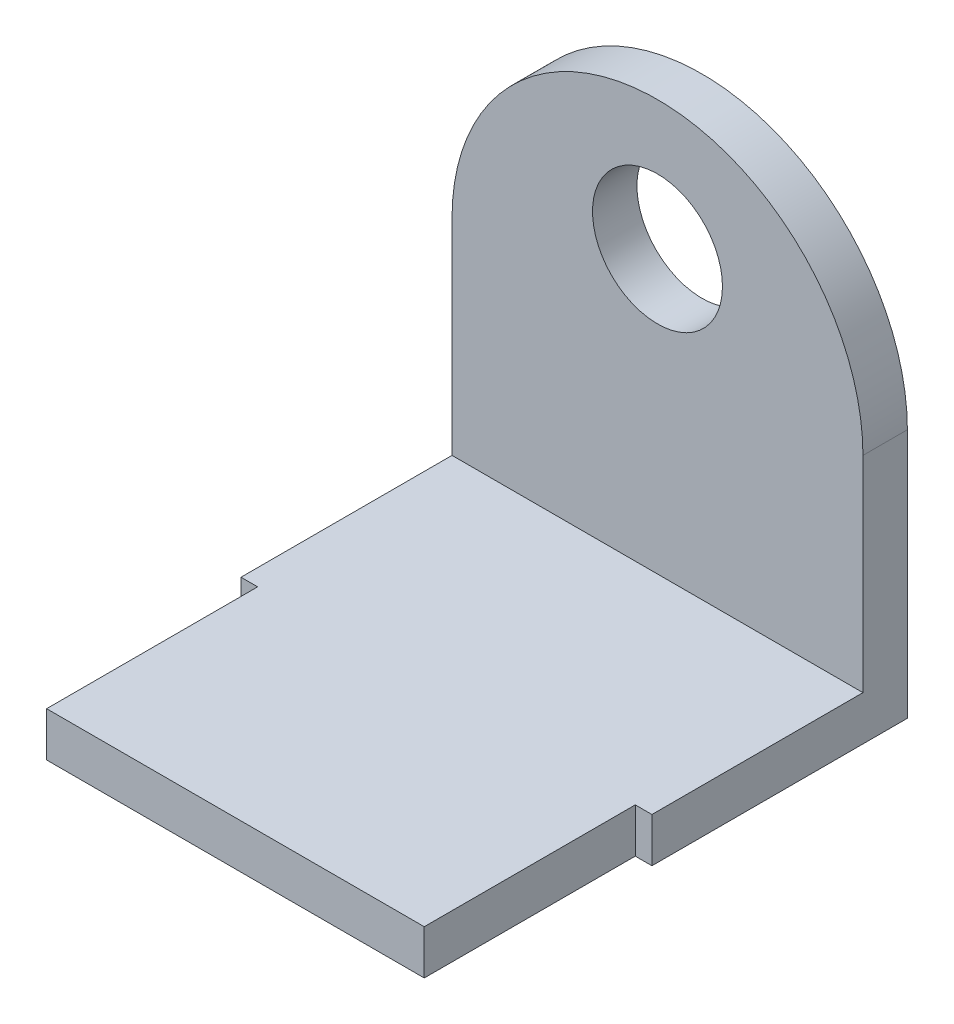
from build123d import *

# Parameters (mm, degrees)
SKETCH1_R           = 5.85
BOSS_EXTRUDE1_DEPTH = 4
SKETCH2_W           = 37
SKETCH2_H           = 4
BOSS_EXTRUDE2_DEPTH = 42
SKETCH3_W           = 1.5
SKETCH3_H           = 19
CUT_EXTRUDE1_DEPTH  = 10


with BuildPart() as part:
    # Sketch1 → Boss-Extrude1 (new body)
    with BuildSketch(Plane.XY):
        with BuildLine():
            Line((-46.110395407, -22.5), (-9.110395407, -22.5))
            Line((-9.110395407, -22.5), (-9.110395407, 0))
            ThreePointArc((-9.110395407, 0), (-27.610395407, 18.5), (-46.110395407, 0))
            Line((-46.110395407, 0), (-46.110395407, -22.5))
        make_face()
        with Locations((-27.610395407, 6.85)):
            Circle(SKETCH1_R, mode=Mode.SUBTRACT)
    extrude(amount=BOSS_EXTRUDE1_DEPTH)

    # Sketch2 → Boss-Extrude2 (add)
    with BuildSketch(Plane.XY):
        with Locations((-27.610395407, -20.5)):
            Rectangle(SKETCH2_W, SKETCH2_H)
    extrude(amount=BOSS_EXTRUDE2_DEPTH)

    # Sketch3 → Cut-Extrude1 (cut)
    with BuildSketch(Plane(origin=(0, -18.5, 0), x_dir=(1, 0, 0), z_dir=(0, 1, 0))):
        with Locations((-9.860395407, -32.5)):
            Rectangle(SKETCH3_W, SKETCH3_H)
        with Locations((-45.360395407, -32.5)):
            Rectangle(SKETCH3_W, SKETCH3_H)
    extrude(amount=-CUT_EXTRUDE1_DEPTH, mode=Mode.SUBTRACT)


solid = part.part
